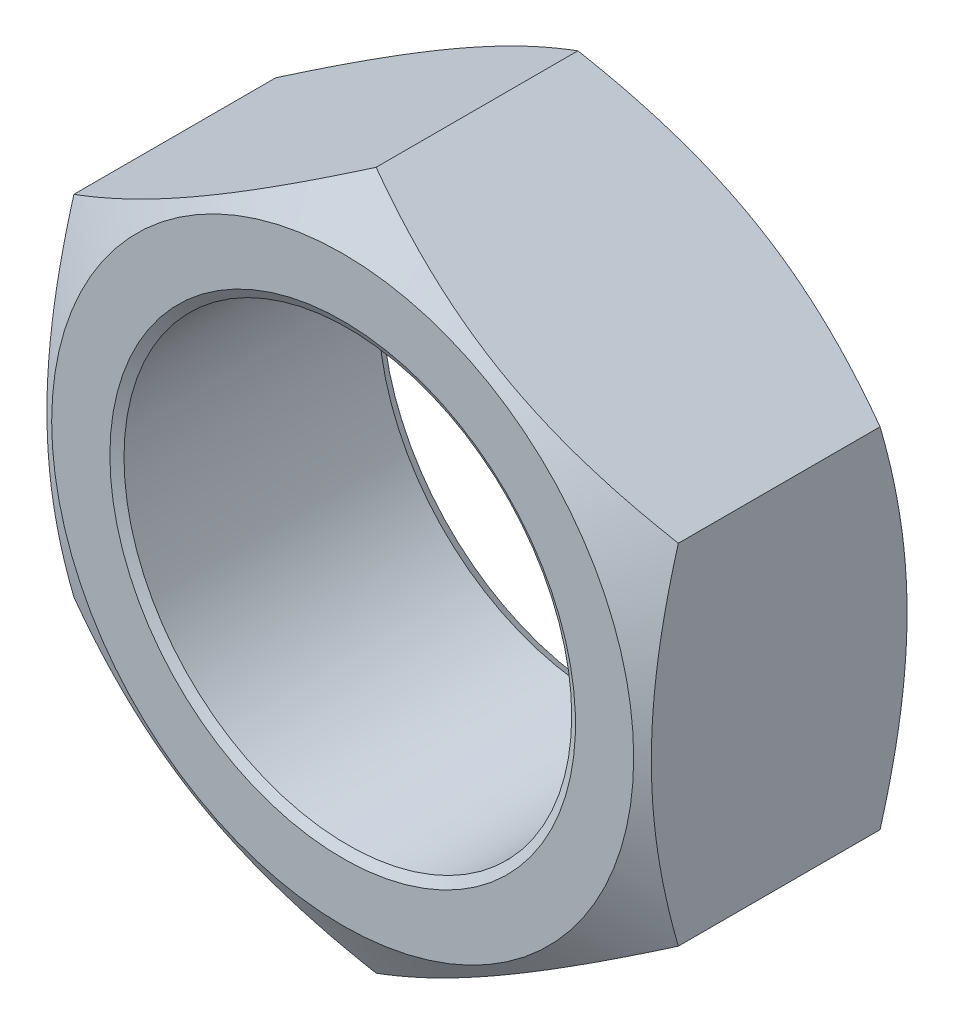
ISO-10303-21;
HEADER;
FILE_DESCRIPTION(('STEP AP214'),'2;1');
FILE_NAME('part.step','',(''),(''),'','','');
FILE_SCHEMA(('AUTOMOTIVE_DESIGN { 1 0 10303 214 1 1 1 1 }'));
ENDSEC;
DATA;
#1=APPLICATION_CONTEXT('core data for automotive mechanical design processes');
#2=APPLICATION_PROTOCOL_DEFINITION('international standard','automotive_design',2000,#1);
#3=PRODUCT_CONTEXT('',#1,'mechanical');
#4=PRODUCT('Part','Part','',(#3));
#5=PRODUCT_RELATED_PRODUCT_CATEGORY('part','',(#4));
#6=PRODUCT_DEFINITION_FORMATION('','',#4);
#7=PRODUCT_DEFINITION_CONTEXT('part definition',#1,'design');
#8=PRODUCT_DEFINITION('design','',#6,#7);
#9=PRODUCT_DEFINITION_SHAPE('','',#8);
#10=(LENGTH_UNIT() NAMED_UNIT(*) SI_UNIT(.MILLI.,.METRE.));
#11=(NAMED_UNIT(*) PLANE_ANGLE_UNIT() SI_UNIT($,.RADIAN.));
#12=(NAMED_UNIT(*) SI_UNIT($,.STERADIAN.) SOLID_ANGLE_UNIT());
#13=UNCERTAINTY_MEASURE_WITH_UNIT(LENGTH_MEASURE(1.E-05),#10,'distance_accuracy_value','');
#14=(GEOMETRIC_REPRESENTATION_CONTEXT(3) GLOBAL_UNCERTAINTY_ASSIGNED_CONTEXT((#13)) GLOBAL_UNIT_ASSIGNED_CONTEXT((#10,
#11,#12)) REPRESENTATION_CONTEXT('',''));
#15=CARTESIAN_POINT('',(0.,0.,0.));
#16=DIRECTION('',(0.,0.,1.));
#17=DIRECTION('',(1.,0.,0.));
#18=AXIS2_PLACEMENT_3D('',#15,#16,#17);
#19=CARTESIAN_POINT('',(17.145,9.89867036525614,7.62));
#20=DIRECTION('',(0.,0.,-1.));
#21=DIRECTION('',(-1.,0.,0.));
#22=AXIS2_PLACEMENT_3D('',#19,#20,#21);
#23=PLANE('',#22);
#24=CARTESIAN_POINT('',(0.,0.,7.62));
#25=DIRECTION('',(0.,0.,-1.));
#26=DIRECTION('',(-1.,0.,0.));
#27=AXIS2_PLACEMENT_3D('',#24,#25,#26);
#28=CIRCLE('',#27,13.208);
#29=CARTESIAN_POINT('',(-13.208,0.,7.62));
#30=VERTEX_POINT('',#29);
#31=EDGE_CURVE('E12',#30,#30,#28,.T.);
#32=ORIENTED_EDGE('',*,*,#31,.T.);
#33=EDGE_LOOP('',(#32));
#34=FACE_BOUND('',#33,.T.);
#35=CARTESIAN_POINT('',(0.,0.,7.62));
#36=DIRECTION('',(0.,0.,1.));
#37=DIRECTION('',(1.,0.,0.));
#38=AXIS2_PLACEMENT_3D('',#35,#36,#37);
#39=CIRCLE('',#38,16.51);
#40=CARTESIAN_POINT('',(16.51,0.,7.62));
#41=VERTEX_POINT('',#40);
#42=EDGE_CURVE('E202',#41,#41,#39,.T.);
#43=ORIENTED_EDGE('',*,*,#42,.T.);
#44=EDGE_LOOP('',(#43));
#45=FACE_BOUND('',#44,.T.);
#46=ADVANCED_FACE('F33',(#34,#45),#23,.F.);
#47=CARTESIAN_POINT('',(17.145,9.89867036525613,7.62));
#48=DIRECTION('',(-0.5,-0.866025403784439,0.));
#49=DIRECTION('',(0.866025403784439,-0.5,0.));
#50=AXIS2_PLACEMENT_3D('',#47,#48,#49);
#51=PLANE('',#50);
#52=DIRECTION('',(0.,0.,-1.));
#53=VECTOR('',#52,1.);
#54=CARTESIAN_POINT('',(17.145,9.89867036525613,7.62));
#55=LINE('',#54,#53);
#56=CARTESIAN_POINT('',(17.145,9.89867036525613,5.72205294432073));
#57=VERTEX_POINT('',#56);
#58=CARTESIAN_POINT('',(17.145,9.89867036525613,-5.72205294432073));
#59=VERTEX_POINT('',#58);
#60=EDGE_CURVE('E105',#57,#59,#55,.T.);
#61=ORIENTED_EDGE('',*,*,#60,.T.);
#62=CARTESIAN_POINT('',(17.1452,9.8985548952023,-5.72198627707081));
#63=CARTESIAN_POINT('',(16.7683598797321,10.1161236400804,-5.84759111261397));
#64=CARTESIAN_POINT('',(16.3900498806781,10.3345410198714,-5.96749620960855));
#65=CARTESIAN_POINT('',(15.6303962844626,10.7731272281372,-6.19432259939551));
#66=CARTESIAN_POINT('',(15.2490517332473,10.9932966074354,-6.30123962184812));
#67=CARTESIAN_POINT('',(14.4825920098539,11.4358123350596,-6.50065268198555));
#68=CARTESIAN_POINT('',(14.0974701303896,11.6581625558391,-6.59311459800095));
#69=CARTESIAN_POINT('',(13.3245503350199,12.1044080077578,-6.76163198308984));
#70=CARTESIAN_POINT('',(12.9367525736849,12.3283031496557,-6.83768839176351));
#71=CARTESIAN_POINT('',(12.1684177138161,12.7719014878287,-6.97015986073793));
#72=CARTESIAN_POINT('',(11.7879376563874,12.9915717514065,-7.02701337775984));
#73=CARTESIAN_POINT('',(11.0252341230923,13.4319188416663,-7.1223440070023));
#74=CARTESIAN_POINT('',(10.6430106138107,13.6525956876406,-7.16082076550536));
#75=CARTESIAN_POINT('',(9.87792152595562,14.0943200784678,-7.2184263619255));
#76=CARTESIAN_POINT('',(9.49505725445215,14.3153668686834,-7.23757819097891));
#77=CARTESIAN_POINT('',(8.72897530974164,14.7576644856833,-7.2561220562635));
#78=CARTESIAN_POINT('',(8.34575764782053,14.9789153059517,-7.25551470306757));
#79=CARTESIAN_POINT('',(7.62932277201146,15.3925491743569,-7.23592013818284));
#80=CARTESIAN_POINT('',(7.29605451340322,15.5849616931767,-7.21932230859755));
#81=CARTESIAN_POINT('',(6.63031296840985,15.9693277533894,-7.17149744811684));
#82=CARTESIAN_POINT('',(6.29783967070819,16.1612813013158,-7.14027062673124));
#83=CARTESIAN_POINT('',(5.63381401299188,16.5446566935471,-7.06372962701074));
#84=CARTESIAN_POINT('',(5.30226276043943,16.7360778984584,-7.0184027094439));
#85=CARTESIAN_POINT('',(4.6407385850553,17.1180090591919,-6.91446136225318));
#86=CARTESIAN_POINT('',(4.31076565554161,17.3085190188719,-6.85584698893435));
#87=CARTESIAN_POINT('',(3.30909024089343,17.8868365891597,-6.6585819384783));
#88=CARTESIAN_POINT('',(2.64028851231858,18.2729694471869,-6.50026135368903));
#89=CARTESIAN_POINT('',(1.31265759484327,19.0394775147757,-6.1409385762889));
#90=CARTESIAN_POINT('',(0.653811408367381,19.4198625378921,-5.94002076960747));
#91=CARTESIAN_POINT('',(-0.000199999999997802,19.7974562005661,-5.72198627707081));
#92=B_SPLINE_CURVE_WITH_KNOTS('',3,(#62,#63,#64,#65,#66,#67,#68,#69,#70,#71,#72,#73,#74,#75,#76,
#77,#78,#79,#80,#81,#82,#83,#84,#85,#86,#87,#88,#89,#90,#91),.UNSPECIFIED.,.F.,.F.,(4,2,2,2,2,2,
2,2,2,2,2,2,2,2,4),(0.,1.35874482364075,2.7179351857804,4.08028702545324,5.442560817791,
6.77121074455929,8.09988624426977,9.42697912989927,10.754031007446,11.9093009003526,
13.0645542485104,14.2208543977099,15.3771496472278,17.7406738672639,20.0995589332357),.UNSPECIFIED.);
#93=CARTESIAN_POINT('',(0.,19.7973407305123,-5.72205294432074));
#94=VERTEX_POINT('',#93);
#95=EDGE_CURVE('E48',#59,#94,#92,.T.);
#96=ORIENTED_EDGE('',*,*,#95,.T.);
#97=DIRECTION('',(0.,0.,-1.));
#98=VECTOR('',#97,1.);
#99=CARTESIAN_POINT('',(0.,19.7973407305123,7.62));
#100=LINE('',#99,#98);
#101=CARTESIAN_POINT('',(0.,19.7973407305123,5.72205294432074));
#102=VERTEX_POINT('',#101);
#103=EDGE_CURVE('E118',#102,#94,#100,.T.);
#104=ORIENTED_EDGE('',*,*,#103,.F.);
#105=CARTESIAN_POINT('',(17.1452,9.8985548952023,5.72198627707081));
#106=CARTESIAN_POINT('',(16.7683598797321,10.1161236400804,5.84759111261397));
#107=CARTESIAN_POINT('',(16.3900498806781,10.3345410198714,5.96749620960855));
#108=CARTESIAN_POINT('',(15.6303962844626,10.7731272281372,6.19432259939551));
#109=CARTESIAN_POINT('',(15.2490517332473,10.9932966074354,6.30123962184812));
#110=CARTESIAN_POINT('',(14.4825920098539,11.4358123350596,6.50065268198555));
#111=CARTESIAN_POINT('',(14.0974701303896,11.6581625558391,6.59311459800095));
#112=CARTESIAN_POINT('',(13.3245503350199,12.1044080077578,6.76163198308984));
#113=CARTESIAN_POINT('',(12.9367525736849,12.3283031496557,6.83768839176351));
#114=CARTESIAN_POINT('',(12.1684177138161,12.7719014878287,6.97015986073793));
#115=CARTESIAN_POINT('',(11.7879376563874,12.9915717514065,7.02701337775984));
#116=CARTESIAN_POINT('',(11.0252341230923,13.4319188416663,7.1223440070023));
#117=CARTESIAN_POINT('',(10.6430106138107,13.6525956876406,7.16082076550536));
#118=CARTESIAN_POINT('',(9.87792152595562,14.0943200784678,7.2184263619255));
#119=CARTESIAN_POINT('',(9.49505725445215,14.3153668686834,7.23757819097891));
#120=CARTESIAN_POINT('',(8.72897530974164,14.7576644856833,7.2561220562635));
#121=CARTESIAN_POINT('',(8.34575764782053,14.9789153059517,7.25551470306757));
#122=CARTESIAN_POINT('',(7.62932277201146,15.3925491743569,7.23592013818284));
#123=CARTESIAN_POINT('',(7.29605451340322,15.5849616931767,7.21932230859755));
#124=CARTESIAN_POINT('',(6.63031296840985,15.9693277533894,7.17149744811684));
#125=CARTESIAN_POINT('',(6.29783967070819,16.1612813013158,7.14027062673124));
#126=CARTESIAN_POINT('',(5.63381401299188,16.5446566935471,7.06372962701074));
#127=CARTESIAN_POINT('',(5.30226276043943,16.7360778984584,7.0184027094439));
#128=CARTESIAN_POINT('',(4.6407385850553,17.1180090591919,6.91446136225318));
#129=CARTESIAN_POINT('',(4.31076565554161,17.3085190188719,6.85584698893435));
#130=CARTESIAN_POINT('',(3.30909024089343,17.8868365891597,6.6585819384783));
#131=CARTESIAN_POINT('',(2.64028851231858,18.2729694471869,6.50026135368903));
#132=CARTESIAN_POINT('',(1.31265759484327,19.0394775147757,6.1409385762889));
#133=CARTESIAN_POINT('',(0.653811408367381,19.4198625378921,5.94002076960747));
#134=CARTESIAN_POINT('',(-0.000199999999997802,19.7974562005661,5.72198627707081));
#135=B_SPLINE_CURVE_WITH_KNOTS('',3,(#105,#106,#107,#108,#109,#110,#111,#112,#113,#114,#115,
#116,#117,#118,#119,#120,#121,#122,#123,#124,#125,#126,#127,#128,#129,#130,#131,#132,#133,#134),
.UNSPECIFIED.,.F.,.F.,(4,2,2,2,2,2,2,2,2,2,2,2,2,2,4),(0.,1.35874482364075,2.7179351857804,
4.08028702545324,5.442560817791,6.77121074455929,8.09988624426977,9.42697912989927,
10.754031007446,11.9093009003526,13.0645542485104,14.2208543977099,15.3771496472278,
17.7406738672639,20.0995589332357),.UNSPECIFIED.);
#136=EDGE_CURVE('E109',#57,#102,#135,.T.);
#137=ORIENTED_EDGE('',*,*,#136,.F.);
#138=EDGE_LOOP('',(#61,#96,#104,#137));
#139=FACE_BOUND('',#138,.T.);
#140=ADVANCED_FACE('F203',(#139),#51,.F.);
#141=CARTESIAN_POINT('',(0.,19.7973407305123,7.62));
#142=DIRECTION('',(0.499999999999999,-0.866025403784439,0.));
#143=DIRECTION('',(0.866025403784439,0.499999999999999,0.));
#144=AXIS2_PLACEMENT_3D('',#141,#142,#143);
#145=PLANE('',#144);
#146=ORIENTED_EDGE('',*,*,#103,.T.);
#147=CARTESIAN_POINT('',(0.000200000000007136,19.7974562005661,-5.72198627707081));
#148=CARTESIAN_POINT('',(-0.3766401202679,19.579887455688,-5.84759111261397));
#149=CARTESIAN_POINT('',(-0.75495011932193,19.361470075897,-5.96749620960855));
#150=CARTESIAN_POINT('',(-1.51460371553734,18.9228838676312,-6.19432259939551));
#151=CARTESIAN_POINT('',(-1.8959482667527,18.702714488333,-6.30123962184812));
#152=CARTESIAN_POINT('',(-2.66240799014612,18.2601987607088,-6.50065268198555));
#153=CARTESIAN_POINT('',(-3.04752986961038,18.0378485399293,-6.59311459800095));
#154=CARTESIAN_POINT('',(-3.82044966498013,17.5916030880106,-6.76163198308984));
#155=CARTESIAN_POINT('',(-4.20824742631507,17.3677079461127,-6.83768839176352));
#156=CARTESIAN_POINT('',(-4.97658228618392,16.9241096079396,-6.97015986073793));
#157=CARTESIAN_POINT('',(-5.35706234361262,16.7044393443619,-7.02701337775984));
#158=CARTESIAN_POINT('',(-6.11976587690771,16.2640922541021,-7.1223440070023));
#159=CARTESIAN_POINT('',(-6.50198938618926,16.0434154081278,-7.16082076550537));
#160=CARTESIAN_POINT('',(-7.26707847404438,15.6016910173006,-7.2184263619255));
#161=CARTESIAN_POINT('',(-7.64994274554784,15.380644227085,-7.23757819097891));
#162=CARTESIAN_POINT('',(-8.41602469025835,14.9383466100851,-7.2561220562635));
#163=CARTESIAN_POINT('',(-8.79924235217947,14.7170957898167,-7.25551470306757));
#164=CARTESIAN_POINT('',(-9.51567722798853,14.3034619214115,-7.23592013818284));
#165=CARTESIAN_POINT('',(-9.84894548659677,14.1110494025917,-7.21932230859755));
#166=CARTESIAN_POINT('',(-10.5146870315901,13.726683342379,-7.17149744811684));
#167=CARTESIAN_POINT('',(-10.8471603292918,13.5347297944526,-7.14027062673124));
#168=CARTESIAN_POINT('',(-11.5111859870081,13.1513544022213,-7.06372962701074));
#169=CARTESIAN_POINT('',(-11.8427372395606,12.95993319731,-7.01840270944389));
#170=CARTESIAN_POINT('',(-12.5042614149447,12.5780020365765,-6.91446136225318));
#171=CARTESIAN_POINT('',(-12.8342343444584,12.3874920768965,-6.85584698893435));
#172=CARTESIAN_POINT('',(-13.8359097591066,11.8091745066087,-6.6585819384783));
#173=CARTESIAN_POINT('',(-14.5047114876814,11.4230416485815,-6.50026135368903));
#174=CARTESIAN_POINT('',(-15.8323424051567,10.6565335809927,-6.14093857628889));
#175=CARTESIAN_POINT('',(-16.4911885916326,10.2761485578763,-5.94002076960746));
#176=CARTESIAN_POINT('',(-17.1452,9.8985548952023,-5.72198627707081));
#177=B_SPLINE_CURVE_WITH_KNOTS('',3,(#147,#148,#149,#150,#151,#152,#153,#154,#155,#156,#157,
#158,#159,#160,#161,#162,#163,#164,#165,#166,#167,#168,#169,#170,#171,#172,#173,#174,#175,#176),
.UNSPECIFIED.,.F.,.F.,(4,2,2,2,2,2,2,2,2,2,2,2,2,2,4),(0.,1.35874482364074,2.7179351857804,
4.08028702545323,5.44256081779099,6.77121074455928,8.09988624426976,9.42697912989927,
10.754031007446,11.9093009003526,13.0645542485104,14.2208543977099,15.3771496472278,
17.7406738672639,20.0995589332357),.UNSPECIFIED.);
#178=CARTESIAN_POINT('',(-17.145,9.89867036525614,-5.72205294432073));
#179=VERTEX_POINT('',#178);
#180=EDGE_CURVE('E190',#94,#179,#177,.T.);
#181=ORIENTED_EDGE('',*,*,#180,.T.);
#182=DIRECTION('',(0.,0.,-1.));
#183=VECTOR('',#182,1.);
#184=CARTESIAN_POINT('',(-17.145,9.89867036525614,7.62));
#185=LINE('',#184,#183);
#186=CARTESIAN_POINT('',(-17.145,9.89867036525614,5.72205294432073));
#187=VERTEX_POINT('',#186);
#188=EDGE_CURVE('E115',#187,#179,#185,.T.);
#189=ORIENTED_EDGE('',*,*,#188,.F.);
#190=CARTESIAN_POINT('',(0.000200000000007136,19.7974562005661,5.72198627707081));
#191=CARTESIAN_POINT('',(-0.3766401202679,19.579887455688,5.84759111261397));
#192=CARTESIAN_POINT('',(-0.75495011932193,19.361470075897,5.96749620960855));
#193=CARTESIAN_POINT('',(-1.51460371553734,18.9228838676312,6.19432259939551));
#194=CARTESIAN_POINT('',(-1.8959482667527,18.702714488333,6.30123962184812));
#195=CARTESIAN_POINT('',(-2.66240799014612,18.2601987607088,6.50065268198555));
#196=CARTESIAN_POINT('',(-3.04752986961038,18.0378485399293,6.59311459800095));
#197=CARTESIAN_POINT('',(-3.82044966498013,17.5916030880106,6.76163198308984));
#198=CARTESIAN_POINT('',(-4.20824742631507,17.3677079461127,6.83768839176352));
#199=CARTESIAN_POINT('',(-4.97658228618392,16.9241096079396,6.97015986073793));
#200=CARTESIAN_POINT('',(-5.35706234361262,16.7044393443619,7.02701337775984));
#201=CARTESIAN_POINT('',(-6.11976587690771,16.2640922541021,7.1223440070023));
#202=CARTESIAN_POINT('',(-6.50198938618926,16.0434154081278,7.16082076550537));
#203=CARTESIAN_POINT('',(-7.26707847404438,15.6016910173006,7.2184263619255));
#204=CARTESIAN_POINT('',(-7.64994274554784,15.380644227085,7.23757819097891));
#205=CARTESIAN_POINT('',(-8.41602469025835,14.9383466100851,7.2561220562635));
#206=CARTESIAN_POINT('',(-8.79924235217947,14.7170957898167,7.25551470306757));
#207=CARTESIAN_POINT('',(-9.51567722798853,14.3034619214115,7.23592013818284));
#208=CARTESIAN_POINT('',(-9.84894548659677,14.1110494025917,7.21932230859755));
#209=CARTESIAN_POINT('',(-10.5146870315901,13.726683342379,7.17149744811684));
#210=CARTESIAN_POINT('',(-10.8471603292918,13.5347297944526,7.14027062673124));
#211=CARTESIAN_POINT('',(-11.5111859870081,13.1513544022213,7.06372962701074));
#212=CARTESIAN_POINT('',(-11.8427372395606,12.95993319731,7.01840270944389));
#213=CARTESIAN_POINT('',(-12.5042614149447,12.5780020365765,6.91446136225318));
#214=CARTESIAN_POINT('',(-12.8342343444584,12.3874920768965,6.85584698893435));
#215=CARTESIAN_POINT('',(-13.8359097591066,11.8091745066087,6.6585819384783));
#216=CARTESIAN_POINT('',(-14.5047114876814,11.4230416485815,6.50026135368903));
#217=CARTESIAN_POINT('',(-15.8323424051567,10.6565335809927,6.14093857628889));
#218=CARTESIAN_POINT('',(-16.4911885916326,10.2761485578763,5.94002076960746));
#219=CARTESIAN_POINT('',(-17.1452,9.8985548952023,5.72198627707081));
#220=B_SPLINE_CURVE_WITH_KNOTS('',3,(#190,#191,#192,#193,#194,#195,#196,#197,#198,#199,#200,
#201,#202,#203,#204,#205,#206,#207,#208,#209,#210,#211,#212,#213,#214,#215,#216,#217,#218,#219),
.UNSPECIFIED.,.F.,.F.,(4,2,2,2,2,2,2,2,2,2,2,2,2,2,4),(0.,1.35874482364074,2.7179351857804,
4.08028702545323,5.44256081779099,6.77121074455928,8.09988624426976,9.42697912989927,
10.754031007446,11.9093009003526,13.0645542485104,14.2208543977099,15.3771496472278,
17.7406738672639,20.0995589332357),.UNSPECIFIED.);
#221=EDGE_CURVE('E168',#102,#187,#220,.T.);
#222=ORIENTED_EDGE('',*,*,#221,.F.);
#223=EDGE_LOOP('',(#146,#181,#189,#222));
#224=FACE_BOUND('',#223,.T.);
#225=ADVANCED_FACE('F177',(#224),#145,.F.);
#226=CARTESIAN_POINT('',(-17.145,9.89867036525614,7.62));
#227=DIRECTION('',(1.,0.,0.));
#228=DIRECTION('',(0.,1.,0.));
#229=AXIS2_PLACEMENT_3D('',#226,#227,#228);
#230=PLANE('',#229);
#231=ORIENTED_EDGE('',*,*,#188,.T.);
#232=CARTESIAN_POINT('',(-17.145,-26.9599779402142,1.29418818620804));
#233=CARTESIAN_POINT('',(-17.145,-26.5839206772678,1.11098372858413));
#234=CARTESIAN_POINT('',(-17.145,-26.2074319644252,0.92866530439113));
#235=CARTESIAN_POINT('',(-17.145,-25.4535017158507,0.566000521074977));
#236=CARTESIAN_POINT('',(-17.145,-25.0760601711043,0.38565418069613));
#237=CARTESIAN_POINT('',(-17.145,-23.9420758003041,-0.152171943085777));
#238=CARTESIAN_POINT('',(-17.145,-23.1839789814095,-0.506387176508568));
#239=CARTESIAN_POINT('',(-17.145,-21.6588840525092,-1.20586667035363));
#240=CARTESIAN_POINT('',(-17.145,-20.8918601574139,-1.55107484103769));
#241=CARTESIAN_POINT('',(-17.145,-19.3518396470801,-2.22785305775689));
#242=CARTESIAN_POINT('',(-17.145,-18.5788433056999,-2.5594237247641));
#243=CARTESIAN_POINT('',(-17.145,-16.9995513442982,-3.21618225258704));
#244=CARTESIAN_POINT('',(-17.145,-16.1930095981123,-3.54078124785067));
#245=CARTESIAN_POINT('',(-17.145,-14.570623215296,-4.16629972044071));
#246=CARTESIAN_POINT('',(-17.145,-13.7547775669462,-4.46721659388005));
#247=CARTESIAN_POINT('',(-17.145,-12.1139206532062,-5.03773845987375));
#248=CARTESIAN_POINT('',(-17.145,-11.2889305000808,-5.30740370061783));
#249=CARTESIAN_POINT('',(-17.145,-9.62704642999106,-5.8070335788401));
#250=CARTESIAN_POINT('',(-17.145,-8.79015622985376,-6.03701032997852));
#251=CARTESIAN_POINT('',(-17.145,-7.52799258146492,-6.34345666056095));
#252=CARTESIAN_POINT('',(-17.145,-7.10731775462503,-6.43897204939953));
#253=CARTESIAN_POINT('',(-17.145,-6.26302714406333,-6.61605368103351));
#254=CARTESIAN_POINT('',(-17.145,-5.83941141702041,-6.69762019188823));
#255=CARTESIAN_POINT('',(-17.145,-4.98950520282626,-6.84538798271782));
#256=CARTESIAN_POINT('',(-17.145,-4.56321477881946,-6.91158962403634));
#257=CARTESIAN_POINT('',(-17.145,-3.70838067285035,-7.02732217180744));
#258=CARTESIAN_POINT('',(-17.145,-3.27983709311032,-7.07685382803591));
#259=CARTESIAN_POINT('',(-17.145,-2.4268511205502,-7.15762030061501));
#260=CARTESIAN_POINT('',(-17.145,-2.00243138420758,-7.18909291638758));
#261=CARTESIAN_POINT('',(-17.145,-1.15264086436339,-7.23404568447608));
#262=CARTESIAN_POINT('',(-17.145,-0.727270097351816,-7.24752614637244));
#263=CARTESIAN_POINT('',(-17.145,0.123665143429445,-7.25617201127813));
#264=CARTESIAN_POINT('',(-17.145,0.549229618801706,-7.25133725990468));
#265=CARTESIAN_POINT('',(-17.145,1.39976667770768,-7.223474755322));
#266=CARTESIAN_POINT('',(-17.145,1.82473923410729,-7.2004461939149));
#267=CARTESIAN_POINT('',(-17.145,2.83483933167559,-7.12458441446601));
#268=CARTESIAN_POINT('',(-17.145,3.41937926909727,-7.06374468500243));
#269=CARTESIAN_POINT('',(-17.145,4.58433526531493,-6.9108789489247));
#270=CARTESIAN_POINT('',(-17.145,5.16475079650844,-6.81884902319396));
#271=CARTESIAN_POINT('',(-17.145,6.89900662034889,-6.50083678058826));
#272=CARTESIAN_POINT('',(-17.145,8.04528210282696,-6.23298100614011));
#273=CARTESIAN_POINT('',(-17.145,9.76020810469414,-5.76565387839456));
#274=CARTESIAN_POINT('',(-17.145,10.3376691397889,-5.59663193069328));
#275=CARTESIAN_POINT('',(-17.145,11.4869872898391,-5.24033574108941));
#276=CARTESIAN_POINT('',(-17.145,12.0588443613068,-5.05306135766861));
#277=CARTESIAN_POINT('',(-17.145,13.1971327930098,-4.66332075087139));
#278=CARTESIAN_POINT('',(-17.145,13.76356564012,-4.46085883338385));
#279=CARTESIAN_POINT('',(-17.145,14.6096527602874,-4.14761460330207));
#280=CARTESIAN_POINT('',(-17.145,14.8910864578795,-4.0416086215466));
#281=CARTESIAN_POINT('',(-17.145,15.4528378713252,-3.82667659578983));
#282=CARTESIAN_POINT('',(-17.145,15.7331555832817,-3.71775054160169));
#283=CARTESIAN_POINT('',(-17.145,16.4952222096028,-3.41743639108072));
#284=CARTESIAN_POINT('',(-17.145,16.9759357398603,-3.2234185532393));
#285=CARTESIAN_POINT('',(-17.145,17.9345610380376,-2.8285671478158));
#286=CARTESIAN_POINT('',(-17.145,18.4124727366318,-2.62773341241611));
#287=CARTESIAN_POINT('',(-17.145,19.3658207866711,-2.22017017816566));
#288=CARTESIAN_POINT('',(-17.145,19.8412569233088,-2.01344017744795));
#289=CARTESIAN_POINT('',(-17.145,20.7898817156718,-1.5948813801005));
#290=CARTESIAN_POINT('',(-17.145,21.2630703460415,-1.38305252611));
#291=CARTESIAN_POINT('',(-17.145,22.6799876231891,-0.740780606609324));
#292=CARTESIAN_POINT('',(-17.145,23.6207119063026,-0.303705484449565));
#293=CARTESIAN_POINT('',(-17.145,25.4957011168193,0.5839222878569));
#294=CARTESIAN_POINT('',(-17.145,26.42996631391,1.03447437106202));
#295=CARTESIAN_POINT('',(-17.145,28.2948577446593,1.94685240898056));
#296=CARTESIAN_POINT('',(-17.145,29.2254755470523,2.40869556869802));
#297=CARTESIAN_POINT('',(-17.145,31.0825189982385,3.34073898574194));
#298=CARTESIAN_POINT('',(-17.145,32.0089446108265,3.81093931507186));
#299=CARTESIAN_POINT('',(-17.145,33.8581514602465,4.7579394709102));
#300=CARTESIAN_POINT('',(-17.145,34.7809334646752,5.2347378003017));
#301=CARTESIAN_POINT('',(-17.145,36.6236552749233,6.19378285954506));
#302=CARTESIAN_POINT('',(-17.145,37.54359509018,6.67602957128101));
#303=CARTESIAN_POINT('',(-17.145,39.2825954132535,7.5930602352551));
#304=CARTESIAN_POINT('',(-17.145,40.1018961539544,8.02738900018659));
#305=CARTESIAN_POINT('',(-17.145,41.7388804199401,8.89908455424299));
#306=CARTESIAN_POINT('',(-17.145,42.5565639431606,9.3364513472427));
#307=CARTESIAN_POINT('',(-17.145,45.0076343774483,10.6524792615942));
#308=CARTESIAN_POINT('',(-17.145,46.6389410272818,11.5350149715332));
#309=CARTESIAN_POINT('',(-17.145,49.8918474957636,13.3047636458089));
#310=CARTESIAN_POINT('',(-17.145,51.5134614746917,14.1919506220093));
#311=CARTESIAN_POINT('',(-17.145,53.9433995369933,15.5270933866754));
#312=CARTESIAN_POINT('',(-17.145,54.7529329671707,15.9728502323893));
#313=CARTESIAN_POINT('',(-17.145,56.3712805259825,16.8656655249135));
#314=CARTESIAN_POINT('',(-17.145,57.1800946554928,17.3127239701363));
#315=CARTESIAN_POINT('',(-17.145,57.9885935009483,17.7603517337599));
#316=B_SPLINE_CURVE_WITH_KNOTS('',3,(#232,#233,#234,#235,#236,#237,#238,#239,#240,#241,#242,
#243,#244,#245,#246,#247,#248,#249,#250,#251,#252,#253,#254,#255,#256,#257,#258,#259,#260,#261,
#262,#263,#264,#265,#266,#267,#268,#269,#270,#271,#272,#273,#274,#275,#276,#277,#278,#279,#280,
#281,#282,#283,#284,#285,#286,#287,#288,#289,#290,#291,#292,#293,#294,#295,#296,#297,#298,#299,
#300,#301,#302,#303,#304,#305,#306,#307,#308,#309,#310,#311,#312,#313,#314,#315),.UNSPECIFIED.,
.F.,.F.,(4,2,2,2,2,2,2,2,2,2,2,2,2,2,2,2,2,2,2,2,2,2,2,2,2,2,2,2,2,2,2,2,2,2,2,2,2,2,2,2,2,4),
(0.,1.25492670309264,2.50986532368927,5.02009560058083,7.54337245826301,10.0665342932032,
12.6744808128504,15.2827136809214,17.8858315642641,20.4881535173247,21.7821059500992,
23.0760335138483,24.3699306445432,25.6637695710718,26.9401554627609,28.2165193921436,
29.4928940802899,30.7693254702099,32.5314307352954,34.2937574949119,37.8201315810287,
39.6250368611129,41.4299561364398,43.2343656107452,44.1365596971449,45.0387569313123,
46.5938613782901,48.1490041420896,49.7042796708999,51.259572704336,54.3713206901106,
57.4829379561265,60.5996353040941,63.716359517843,66.8323877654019,69.9484056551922,
72.7303144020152,75.5122266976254,81.076391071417,86.6216981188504,89.3941314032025,
92.1665613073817),.UNSPECIFIED.);
#317=CARTESIAN_POINT('',(-17.145,-9.89867036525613,-5.72205294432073));
#318=VERTEX_POINT('',#317);
#319=EDGE_CURVE('E183',#179,#318,#316,.F.);
#320=ORIENTED_EDGE('',*,*,#319,.T.);
#321=DIRECTION('',(0.,0.,-1.));
#322=VECTOR('',#321,1.);
#323=CARTESIAN_POINT('',(-17.145,-9.89867036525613,7.62));
#324=LINE('',#323,#322);
#325=CARTESIAN_POINT('',(-17.145,-9.89867036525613,5.72205294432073));
#326=VERTEX_POINT('',#325);
#327=EDGE_CURVE('E107',#326,#318,#324,.T.);
#328=ORIENTED_EDGE('',*,*,#327,.F.);
#329=CARTESIAN_POINT('',(-17.145,-26.9599779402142,-1.29418818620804));
#330=CARTESIAN_POINT('',(-17.145,-26.5839206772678,-1.11098372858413));
#331=CARTESIAN_POINT('',(-17.145,-26.2074319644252,-0.92866530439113));
#332=CARTESIAN_POINT('',(-17.145,-25.4535017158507,-0.566000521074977));
#333=CARTESIAN_POINT('',(-17.145,-25.0760601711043,-0.38565418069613));
#334=CARTESIAN_POINT('',(-17.145,-23.9420758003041,0.152171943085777));
#335=CARTESIAN_POINT('',(-17.145,-23.1839789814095,0.506387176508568));
#336=CARTESIAN_POINT('',(-17.145,-21.6588840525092,1.20586667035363));
#337=CARTESIAN_POINT('',(-17.145,-20.8918601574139,1.55107484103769));
#338=CARTESIAN_POINT('',(-17.145,-19.3518396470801,2.22785305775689));
#339=CARTESIAN_POINT('',(-17.145,-18.5788433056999,2.5594237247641));
#340=CARTESIAN_POINT('',(-17.145,-16.9995513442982,3.21618225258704));
#341=CARTESIAN_POINT('',(-17.145,-16.1930095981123,3.54078124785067));
#342=CARTESIAN_POINT('',(-17.145,-14.570623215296,4.16629972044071));
#343=CARTESIAN_POINT('',(-17.145,-13.7547775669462,4.46721659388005));
#344=CARTESIAN_POINT('',(-17.145,-12.1139206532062,5.03773845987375));
#345=CARTESIAN_POINT('',(-17.145,-11.2889305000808,5.30740370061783));
#346=CARTESIAN_POINT('',(-17.145,-9.62704642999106,5.8070335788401));
#347=CARTESIAN_POINT('',(-17.145,-8.79015622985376,6.03701032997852));
#348=CARTESIAN_POINT('',(-17.145,-7.52799258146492,6.34345666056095));
#349=CARTESIAN_POINT('',(-17.145,-7.10731775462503,6.43897204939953));
#350=CARTESIAN_POINT('',(-17.145,-6.26302714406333,6.61605368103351));
#351=CARTESIAN_POINT('',(-17.145,-5.83941141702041,6.69762019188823));
#352=CARTESIAN_POINT('',(-17.145,-4.98950520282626,6.84538798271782));
#353=CARTESIAN_POINT('',(-17.145,-4.56321477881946,6.91158962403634));
#354=CARTESIAN_POINT('',(-17.145,-3.70838067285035,7.02732217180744));
#355=CARTESIAN_POINT('',(-17.145,-3.27983709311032,7.07685382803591));
#356=CARTESIAN_POINT('',(-17.145,-2.4268511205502,7.15762030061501));
#357=CARTESIAN_POINT('',(-17.145,-2.00243138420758,7.18909291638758));
#358=CARTESIAN_POINT('',(-17.145,-1.15264086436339,7.23404568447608));
#359=CARTESIAN_POINT('',(-17.145,-0.727270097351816,7.24752614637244));
#360=CARTESIAN_POINT('',(-17.145,0.123665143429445,7.25617201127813));
#361=CARTESIAN_POINT('',(-17.145,0.549229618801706,7.25133725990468));
#362=CARTESIAN_POINT('',(-17.145,1.39976667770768,7.223474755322));
#363=CARTESIAN_POINT('',(-17.145,1.82473923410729,7.2004461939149));
#364=CARTESIAN_POINT('',(-17.145,2.83483933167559,7.12458441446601));
#365=CARTESIAN_POINT('',(-17.145,3.41937926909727,7.06374468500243));
#366=CARTESIAN_POINT('',(-17.145,4.58433526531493,6.9108789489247));
#367=CARTESIAN_POINT('',(-17.145,5.16475079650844,6.81884902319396));
#368=CARTESIAN_POINT('',(-17.145,6.89900662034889,6.50083678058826));
#369=CARTESIAN_POINT('',(-17.145,8.04528210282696,6.23298100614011));
#370=CARTESIAN_POINT('',(-17.145,9.76020810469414,5.76565387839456));
#371=CARTESIAN_POINT('',(-17.145,10.3376691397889,5.59663193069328));
#372=CARTESIAN_POINT('',(-17.145,11.4869872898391,5.24033574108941));
#373=CARTESIAN_POINT('',(-17.145,12.0588443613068,5.05306135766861));
#374=CARTESIAN_POINT('',(-17.145,13.1971327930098,4.66332075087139));
#375=CARTESIAN_POINT('',(-17.145,13.76356564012,4.46085883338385));
#376=CARTESIAN_POINT('',(-17.145,14.6096527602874,4.14761460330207));
#377=CARTESIAN_POINT('',(-17.145,14.8910864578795,4.0416086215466));
#378=CARTESIAN_POINT('',(-17.145,15.4528378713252,3.82667659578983));
#379=CARTESIAN_POINT('',(-17.145,15.7331555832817,3.71775054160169));
#380=CARTESIAN_POINT('',(-17.145,16.4952222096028,3.41743639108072));
#381=CARTESIAN_POINT('',(-17.145,16.9759357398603,3.2234185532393));
#382=CARTESIAN_POINT('',(-17.145,17.9345610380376,2.8285671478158));
#383=CARTESIAN_POINT('',(-17.145,18.4124727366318,2.62773341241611));
#384=CARTESIAN_POINT('',(-17.145,19.3658207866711,2.22017017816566));
#385=CARTESIAN_POINT('',(-17.145,19.8412569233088,2.01344017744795));
#386=CARTESIAN_POINT('',(-17.145,20.7898817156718,1.5948813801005));
#387=CARTESIAN_POINT('',(-17.145,21.2630703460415,1.38305252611));
#388=CARTESIAN_POINT('',(-17.145,22.6799876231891,0.740780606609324));
#389=CARTESIAN_POINT('',(-17.145,23.6207119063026,0.303705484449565));
#390=CARTESIAN_POINT('',(-17.145,25.4957011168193,-0.5839222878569));
#391=CARTESIAN_POINT('',(-17.145,26.42996631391,-1.03447437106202));
#392=CARTESIAN_POINT('',(-17.145,28.2948577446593,-1.94685240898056));
#393=CARTESIAN_POINT('',(-17.145,29.2254755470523,-2.40869556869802));
#394=CARTESIAN_POINT('',(-17.145,31.0825189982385,-3.34073898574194));
#395=CARTESIAN_POINT('',(-17.145,32.0089446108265,-3.81093931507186));
#396=CARTESIAN_POINT('',(-17.145,33.8581514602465,-4.7579394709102));
#397=CARTESIAN_POINT('',(-17.145,34.7809334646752,-5.2347378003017));
#398=CARTESIAN_POINT('',(-17.145,36.6236552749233,-6.19378285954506));
#399=CARTESIAN_POINT('',(-17.145,37.54359509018,-6.67602957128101));
#400=CARTESIAN_POINT('',(-17.145,39.2825954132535,-7.5930602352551));
#401=CARTESIAN_POINT('',(-17.145,40.1018961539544,-8.02738900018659));
#402=CARTESIAN_POINT('',(-17.145,41.7388804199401,-8.89908455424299));
#403=CARTESIAN_POINT('',(-17.145,42.5565639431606,-9.3364513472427));
#404=CARTESIAN_POINT('',(-17.145,45.0076343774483,-10.6524792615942));
#405=CARTESIAN_POINT('',(-17.145,46.6389410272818,-11.5350149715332));
#406=CARTESIAN_POINT('',(-17.145,49.8918474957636,-13.3047636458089));
#407=CARTESIAN_POINT('',(-17.145,51.5134614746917,-14.1919506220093));
#408=CARTESIAN_POINT('',(-17.145,53.9433995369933,-15.5270933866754));
#409=CARTESIAN_POINT('',(-17.145,54.7529329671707,-15.9728502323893));
#410=CARTESIAN_POINT('',(-17.145,56.3712805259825,-16.8656655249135));
#411=CARTESIAN_POINT('',(-17.145,57.1800946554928,-17.3127239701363));
#412=CARTESIAN_POINT('',(-17.145,57.9885935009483,-17.7603517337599));
#413=B_SPLINE_CURVE_WITH_KNOTS('',3,(#329,#330,#331,#332,#333,#334,#335,#336,#337,#338,#339,
#340,#341,#342,#343,#344,#345,#346,#347,#348,#349,#350,#351,#352,#353,#354,#355,#356,#357,#358,
#359,#360,#361,#362,#363,#364,#365,#366,#367,#368,#369,#370,#371,#372,#373,#374,#375,#376,#377,
#378,#379,#380,#381,#382,#383,#384,#385,#386,#387,#388,#389,#390,#391,#392,#393,#394,#395,#396,
#397,#398,#399,#400,#401,#402,#403,#404,#405,#406,#407,#408,#409,#410,#411,#412),.UNSPECIFIED.,
.F.,.F.,(4,2,2,2,2,2,2,2,2,2,2,2,2,2,2,2,2,2,2,2,2,2,2,2,2,2,2,2,2,2,2,2,2,2,2,2,2,2,2,2,2,4),
(0.,1.25492670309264,2.50986532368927,5.02009560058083,7.54337245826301,10.0665342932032,
12.6744808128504,15.2827136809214,17.8858315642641,20.4881535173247,21.7821059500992,
23.0760335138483,24.3699306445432,25.6637695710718,26.9401554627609,28.2165193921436,
29.4928940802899,30.7693254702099,32.5314307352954,34.2937574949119,37.8201315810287,
39.6250368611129,41.4299561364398,43.2343656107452,44.1365596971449,45.0387569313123,
46.5938613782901,48.1490041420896,49.7042796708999,51.259572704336,54.3713206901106,
57.4829379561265,60.5996353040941,63.716359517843,66.8323877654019,69.9484056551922,
72.7303144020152,75.5122266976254,81.076391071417,86.6216981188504,89.3941314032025,
92.1665613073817),.UNSPECIFIED.);
#414=EDGE_CURVE('E163',#187,#326,#413,.F.);
#415=ORIENTED_EDGE('',*,*,#414,.F.);
#416=EDGE_LOOP('',(#231,#320,#328,#415));
#417=FACE_BOUND('',#416,.T.);
#418=ADVANCED_FACE('F173',(#417),#230,.F.);
#419=CARTESIAN_POINT('',(-17.145,-9.89867036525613,7.62));
#420=DIRECTION('',(0.5,0.866025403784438,0.));
#421=DIRECTION('',(-0.866025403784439,0.5,0.));
#422=AXIS2_PLACEMENT_3D('',#419,#420,#421);
#423=PLANE('',#422);
#424=ORIENTED_EDGE('',*,*,#327,.T.);
#425=CARTESIAN_POINT('',(-17.1452,-9.89855489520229,-5.72198627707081));
#426=CARTESIAN_POINT('',(-16.7683598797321,-10.1161236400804,-5.84759111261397));
#427=CARTESIAN_POINT('',(-16.3900498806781,-10.3345410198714,-5.96749620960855));
#428=CARTESIAN_POINT('',(-15.6303962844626,-10.7731272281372,-6.19432259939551));
#429=CARTESIAN_POINT('',(-15.2490517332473,-10.9932966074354,-6.30123962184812));
#430=CARTESIAN_POINT('',(-14.4825920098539,-11.4358123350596,-6.50065268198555));
#431=CARTESIAN_POINT('',(-14.0974701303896,-11.6581625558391,-6.59311459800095));
#432=CARTESIAN_POINT('',(-13.3245503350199,-12.1044080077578,-6.76163198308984));
#433=CARTESIAN_POINT('',(-12.9367525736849,-12.3283031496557,-6.83768839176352));
#434=CARTESIAN_POINT('',(-12.1684177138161,-12.7719014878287,-6.97015986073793));
#435=CARTESIAN_POINT('',(-11.7879376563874,-12.9915717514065,-7.02701337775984));
#436=CARTESIAN_POINT('',(-11.0252341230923,-13.4319188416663,-7.1223440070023));
#437=CARTESIAN_POINT('',(-10.6430106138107,-13.6525956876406,-7.16082076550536));
#438=CARTESIAN_POINT('',(-9.87792152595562,-14.0943200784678,-7.2184263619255));
#439=CARTESIAN_POINT('',(-9.49505725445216,-14.3153668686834,-7.23757819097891));
#440=CARTESIAN_POINT('',(-8.72897530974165,-14.7576644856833,-7.2561220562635));
#441=CARTESIAN_POINT('',(-8.34575764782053,-14.9789153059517,-7.25551470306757));
#442=CARTESIAN_POINT('',(-7.62932277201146,-15.3925491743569,-7.23592013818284));
#443=CARTESIAN_POINT('',(-7.29605451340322,-15.5849616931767,-7.21932230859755));
#444=CARTESIAN_POINT('',(-6.63031296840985,-15.9693277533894,-7.17149744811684));
#445=CARTESIAN_POINT('',(-6.29783967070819,-16.1612813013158,-7.14027062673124));
#446=CARTESIAN_POINT('',(-5.63381401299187,-16.5446566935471,-7.06372962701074));
#447=CARTESIAN_POINT('',(-5.30226276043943,-16.7360778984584,-7.01840270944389));
#448=CARTESIAN_POINT('',(-4.6407385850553,-17.1180090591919,-6.91446136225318));
#449=CARTESIAN_POINT('',(-4.3107656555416,-17.3085190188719,-6.85584698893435));
#450=CARTESIAN_POINT('',(-3.30909024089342,-17.8868365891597,-6.65858193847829));
#451=CARTESIAN_POINT('',(-2.64028851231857,-18.2729694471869,-6.50026135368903));
#452=CARTESIAN_POINT('',(-1.31265759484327,-19.0394775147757,-6.14093857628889));
#453=CARTESIAN_POINT('',(-0.653811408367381,-19.4198625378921,-5.94002076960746));
#454=CARTESIAN_POINT('',(0.000200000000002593,-19.7974562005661,-5.72198627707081));
#455=B_SPLINE_CURVE_WITH_KNOTS('',3,(#425,#426,#427,#428,#429,#430,#431,#432,#433,#434,#435,
#436,#437,#438,#439,#440,#441,#442,#443,#444,#445,#446,#447,#448,#449,#450,#451,#452,#453,#454),
.UNSPECIFIED.,.F.,.F.,(4,2,2,2,2,2,2,2,2,2,2,2,2,2,4),(0.,1.35874482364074,2.71793518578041,
4.08028702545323,5.442560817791,6.77121074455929,8.09988624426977,9.42697912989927,
10.754031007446,11.9093009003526,13.0645542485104,14.2208543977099,15.3771496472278,
17.7406738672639,20.0995589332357),.UNSPECIFIED.);
#456=CARTESIAN_POINT('',(0.,-19.7973407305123,-5.72205294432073));
#457=VERTEX_POINT('',#456);
#458=EDGE_CURVE('E101',#318,#457,#455,.T.);
#459=ORIENTED_EDGE('',*,*,#458,.T.);
#460=DIRECTION('',(0.,0.,-1.));
#461=VECTOR('',#460,1.);
#462=CARTESIAN_POINT('',(0.,-19.7973407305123,7.62));
#463=LINE('',#462,#461);
#464=CARTESIAN_POINT('',(0.,-19.7973407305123,5.72205294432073));
#465=VERTEX_POINT('',#464);
#466=EDGE_CURVE('E100',#465,#457,#463,.T.);
#467=ORIENTED_EDGE('',*,*,#466,.F.);
#468=CARTESIAN_POINT('',(-17.1452,-9.89855489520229,5.72198627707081));
#469=CARTESIAN_POINT('',(-16.7683598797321,-10.1161236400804,5.84759111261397));
#470=CARTESIAN_POINT('',(-16.3900498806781,-10.3345410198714,5.96749620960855));
#471=CARTESIAN_POINT('',(-15.6303962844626,-10.7731272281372,6.19432259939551));
#472=CARTESIAN_POINT('',(-15.2490517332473,-10.9932966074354,6.30123962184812));
#473=CARTESIAN_POINT('',(-14.4825920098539,-11.4358123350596,6.50065268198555));
#474=CARTESIAN_POINT('',(-14.0974701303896,-11.6581625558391,6.59311459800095));
#475=CARTESIAN_POINT('',(-13.3245503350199,-12.1044080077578,6.76163198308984));
#476=CARTESIAN_POINT('',(-12.9367525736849,-12.3283031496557,6.83768839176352));
#477=CARTESIAN_POINT('',(-12.1684177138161,-12.7719014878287,6.97015986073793));
#478=CARTESIAN_POINT('',(-11.7879376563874,-12.9915717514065,7.02701337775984));
#479=CARTESIAN_POINT('',(-11.0252341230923,-13.4319188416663,7.1223440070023));
#480=CARTESIAN_POINT('',(-10.6430106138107,-13.6525956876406,7.16082076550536));
#481=CARTESIAN_POINT('',(-9.87792152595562,-14.0943200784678,7.2184263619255));
#482=CARTESIAN_POINT('',(-9.49505725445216,-14.3153668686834,7.23757819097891));
#483=CARTESIAN_POINT('',(-8.72897530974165,-14.7576644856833,7.2561220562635));
#484=CARTESIAN_POINT('',(-8.34575764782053,-14.9789153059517,7.25551470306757));
#485=CARTESIAN_POINT('',(-7.62932277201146,-15.3925491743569,7.23592013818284));
#486=CARTESIAN_POINT('',(-7.29605451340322,-15.5849616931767,7.21932230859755));
#487=CARTESIAN_POINT('',(-6.63031296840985,-15.9693277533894,7.17149744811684));
#488=CARTESIAN_POINT('',(-6.29783967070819,-16.1612813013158,7.14027062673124));
#489=CARTESIAN_POINT('',(-5.63381401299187,-16.5446566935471,7.06372962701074));
#490=CARTESIAN_POINT('',(-5.30226276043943,-16.7360778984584,7.01840270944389));
#491=CARTESIAN_POINT('',(-4.6407385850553,-17.1180090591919,6.91446136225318));
#492=CARTESIAN_POINT('',(-4.3107656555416,-17.3085190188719,6.85584698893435));
#493=CARTESIAN_POINT('',(-3.30909024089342,-17.8868365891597,6.65858193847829));
#494=CARTESIAN_POINT('',(-2.64028851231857,-18.2729694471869,6.50026135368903));
#495=CARTESIAN_POINT('',(-1.31265759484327,-19.0394775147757,6.14093857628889));
#496=CARTESIAN_POINT('',(-0.653811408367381,-19.4198625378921,5.94002076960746));
#497=CARTESIAN_POINT('',(0.000200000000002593,-19.7974562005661,5.72198627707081));
#498=B_SPLINE_CURVE_WITH_KNOTS('',3,(#468,#469,#470,#471,#472,#473,#474,#475,#476,#477,#478,
#479,#480,#481,#482,#483,#484,#485,#486,#487,#488,#489,#490,#491,#492,#493,#494,#495,#496,#497),
.UNSPECIFIED.,.F.,.F.,(4,2,2,2,2,2,2,2,2,2,2,2,2,2,4),(0.,1.35874482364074,2.71793518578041,
4.08028702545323,5.442560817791,6.77121074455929,8.09988624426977,9.42697912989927,
10.754031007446,11.9093009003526,13.0645542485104,14.2208543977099,15.3771496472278,
17.7406738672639,20.0995589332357),.UNSPECIFIED.);
#499=EDGE_CURVE('E157',#326,#465,#498,.T.);
#500=ORIENTED_EDGE('',*,*,#499,.F.);
#501=EDGE_LOOP('',(#424,#459,#467,#500));
#502=FACE_BOUND('',#501,.T.);
#503=ADVANCED_FACE('F176',(#502),#423,.F.);
#504=CARTESIAN_POINT('',(0.,-19.7973407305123,7.62));
#505=DIRECTION('',(-0.5,0.866025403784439,0.));
#506=DIRECTION('',(-0.866025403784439,-0.5,0.));
#507=AXIS2_PLACEMENT_3D('',#504,#505,#506);
#508=PLANE('',#507);
#509=ORIENTED_EDGE('',*,*,#466,.T.);
#510=CARTESIAN_POINT('',(-0.000200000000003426,-19.7974562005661,-5.72198627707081));
#511=CARTESIAN_POINT('',(0.376640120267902,-19.579887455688,-5.84759111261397));
#512=CARTESIAN_POINT('',(0.754950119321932,-19.361470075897,-5.96749620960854));
#513=CARTESIAN_POINT('',(1.51460371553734,-18.9228838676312,-6.1943225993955));
#514=CARTESIAN_POINT('',(1.8959482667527,-18.702714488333,-6.30123962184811));
#515=CARTESIAN_POINT('',(2.66240799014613,-18.2601987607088,-6.50065268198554));
#516=CARTESIAN_POINT('',(3.04752986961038,-18.0378485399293,-6.59311459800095));
#517=CARTESIAN_POINT('',(3.82044966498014,-17.5916030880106,-6.76163198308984));
#518=CARTESIAN_POINT('',(4.20824742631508,-17.3677079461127,-6.83768839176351));
#519=CARTESIAN_POINT('',(4.97658228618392,-16.9241096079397,-6.97015986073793));
#520=CARTESIAN_POINT('',(5.35706234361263,-16.7044393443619,-7.02701337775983));
#521=CARTESIAN_POINT('',(6.11976587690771,-16.2640922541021,-7.1223440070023));
#522=CARTESIAN_POINT('',(6.50198938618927,-16.0434154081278,-7.16082076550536));
#523=CARTESIAN_POINT('',(7.26707847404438,-15.6016910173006,-7.2184263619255));
#524=CARTESIAN_POINT('',(7.64994274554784,-15.380644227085,-7.23757819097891));
#525=CARTESIAN_POINT('',(8.41602469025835,-14.9383466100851,-7.2561220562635));
#526=CARTESIAN_POINT('',(8.79924235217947,-14.7170957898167,-7.25551470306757));
#527=CARTESIAN_POINT('',(9.51567722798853,-14.3034619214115,-7.23592013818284));
#528=CARTESIAN_POINT('',(9.84894548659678,-14.1110494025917,-7.21932230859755));
#529=CARTESIAN_POINT('',(10.5146870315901,-13.726683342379,-7.17149744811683));
#530=CARTESIAN_POINT('',(10.8471603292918,-13.5347297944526,-7.14027062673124));
#531=CARTESIAN_POINT('',(11.5111859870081,-13.1513544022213,-7.06372962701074));
#532=CARTESIAN_POINT('',(11.8427372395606,-12.95993319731,-7.01840270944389));
#533=CARTESIAN_POINT('',(12.5042614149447,-12.5780020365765,-6.91446136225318));
#534=CARTESIAN_POINT('',(12.8342343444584,-12.3874920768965,-6.85584698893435));
#535=CARTESIAN_POINT('',(13.8359097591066,-11.8091745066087,-6.6585819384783));
#536=CARTESIAN_POINT('',(14.5047114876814,-11.4230416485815,-6.50026135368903));
#537=CARTESIAN_POINT('',(15.8323424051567,-10.6565335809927,-6.14093857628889));
#538=CARTESIAN_POINT('',(16.4911885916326,-10.2761485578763,-5.94002076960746));
#539=CARTESIAN_POINT('',(17.1452,-9.89855489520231,-5.72198627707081));
#540=B_SPLINE_CURVE_WITH_KNOTS('',3,(#510,#511,#512,#513,#514,#515,#516,#517,#518,#519,#520,
#521,#522,#523,#524,#525,#526,#527,#528,#529,#530,#531,#532,#533,#534,#535,#536,#537,#538,#539),
.UNSPECIFIED.,.F.,.F.,(4,2,2,2,2,2,2,2,2,2,2,2,2,2,4),(0.,1.35874482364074,2.7179351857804,
4.08028702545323,5.442560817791,6.77121074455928,8.09988624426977,9.42697912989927,
10.754031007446,11.9093009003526,13.0645542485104,14.2208543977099,15.3771496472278,
17.7406738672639,20.0995589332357),.UNSPECIFIED.);
#541=CARTESIAN_POINT('',(17.145,-9.89867036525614,-5.72205294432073));
#542=VERTEX_POINT('',#541);
#543=EDGE_CURVE('E86',#457,#542,#540,.T.);
#544=ORIENTED_EDGE('',*,*,#543,.T.);
#545=DIRECTION('',(0.,0.,-1.));
#546=VECTOR('',#545,1.);
#547=CARTESIAN_POINT('',(17.145,-9.89867036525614,7.62));
#548=LINE('',#547,#546);
#549=CARTESIAN_POINT('',(17.145,-9.89867036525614,5.72205294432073));
#550=VERTEX_POINT('',#549);
#551=EDGE_CURVE('E98',#550,#542,#548,.T.);
#552=ORIENTED_EDGE('',*,*,#551,.F.);
#553=CARTESIAN_POINT('',(-0.000200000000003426,-19.7974562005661,5.72198627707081));
#554=CARTESIAN_POINT('',(0.376640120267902,-19.579887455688,5.84759111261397));
#555=CARTESIAN_POINT('',(0.754950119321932,-19.361470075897,5.96749620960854));
#556=CARTESIAN_POINT('',(1.51460371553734,-18.9228838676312,6.1943225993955));
#557=CARTESIAN_POINT('',(1.8959482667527,-18.702714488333,6.30123962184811));
#558=CARTESIAN_POINT('',(2.66240799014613,-18.2601987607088,6.50065268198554));
#559=CARTESIAN_POINT('',(3.04752986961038,-18.0378485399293,6.59311459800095));
#560=CARTESIAN_POINT('',(3.82044966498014,-17.5916030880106,6.76163198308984));
#561=CARTESIAN_POINT('',(4.20824742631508,-17.3677079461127,6.83768839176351));
#562=CARTESIAN_POINT('',(4.97658228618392,-16.9241096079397,6.97015986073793));
#563=CARTESIAN_POINT('',(5.35706234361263,-16.7044393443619,7.02701337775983));
#564=CARTESIAN_POINT('',(6.11976587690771,-16.2640922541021,7.1223440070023));
#565=CARTESIAN_POINT('',(6.50198938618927,-16.0434154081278,7.16082076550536));
#566=CARTESIAN_POINT('',(7.26707847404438,-15.6016910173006,7.2184263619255));
#567=CARTESIAN_POINT('',(7.64994274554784,-15.380644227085,7.23757819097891));
#568=CARTESIAN_POINT('',(8.41602469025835,-14.9383466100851,7.2561220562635));
#569=CARTESIAN_POINT('',(8.79924235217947,-14.7170957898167,7.25551470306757));
#570=CARTESIAN_POINT('',(9.51567722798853,-14.3034619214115,7.23592013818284));
#571=CARTESIAN_POINT('',(9.84894548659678,-14.1110494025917,7.21932230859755));
#572=CARTESIAN_POINT('',(10.5146870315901,-13.726683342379,7.17149744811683));
#573=CARTESIAN_POINT('',(10.8471603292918,-13.5347297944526,7.14027062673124));
#574=CARTESIAN_POINT('',(11.5111859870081,-13.1513544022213,7.06372962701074));
#575=CARTESIAN_POINT('',(11.8427372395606,-12.95993319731,7.01840270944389));
#576=CARTESIAN_POINT('',(12.5042614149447,-12.5780020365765,6.91446136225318));
#577=CARTESIAN_POINT('',(12.8342343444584,-12.3874920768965,6.85584698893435));
#578=CARTESIAN_POINT('',(13.8359097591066,-11.8091745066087,6.6585819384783));
#579=CARTESIAN_POINT('',(14.5047114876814,-11.4230416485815,6.50026135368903));
#580=CARTESIAN_POINT('',(15.8323424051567,-10.6565335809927,6.14093857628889));
#581=CARTESIAN_POINT('',(16.4911885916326,-10.2761485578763,5.94002076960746));
#582=CARTESIAN_POINT('',(17.1452,-9.89855489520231,5.72198627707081));
#583=B_SPLINE_CURVE_WITH_KNOTS('',3,(#553,#554,#555,#556,#557,#558,#559,#560,#561,#562,#563,
#564,#565,#566,#567,#568,#569,#570,#571,#572,#573,#574,#575,#576,#577,#578,#579,#580,#581,#582),
.UNSPECIFIED.,.F.,.F.,(4,2,2,2,2,2,2,2,2,2,2,2,2,2,4),(0.,1.35874482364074,2.7179351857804,
4.08028702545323,5.442560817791,6.77121074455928,8.09988624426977,9.42697912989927,
10.754031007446,11.9093009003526,13.0645542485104,14.2208543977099,15.3771496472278,
17.7406738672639,20.0995589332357),.UNSPECIFIED.);
#584=EDGE_CURVE('E56',#465,#550,#583,.T.);
#585=ORIENTED_EDGE('',*,*,#584,.F.);
#586=EDGE_LOOP('',(#509,#544,#552,#585));
#587=FACE_BOUND('',#586,.T.);
#588=ADVANCED_FACE('F97',(#587),#508,.F.);
#589=CARTESIAN_POINT('',(17.145,-9.89867036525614,7.62));
#590=DIRECTION('',(-1.,0.,0.));
#591=DIRECTION('',(0.,-1.,0.));
#592=AXIS2_PLACEMENT_3D('',#589,#590,#591);
#593=PLANE('',#592);
#594=ORIENTED_EDGE('',*,*,#551,.T.);
#595=CARTESIAN_POINT('',(17.145,-26.9599779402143,1.29418818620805));
#596=CARTESIAN_POINT('',(17.145,-26.5839206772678,1.11098372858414));
#597=CARTESIAN_POINT('',(17.145,-26.2074319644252,0.928665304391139));
#598=CARTESIAN_POINT('',(17.145,-25.4535017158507,0.566000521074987));
#599=CARTESIAN_POINT('',(17.145,-25.0760601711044,0.38565418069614));
#600=CARTESIAN_POINT('',(17.145,-23.9420758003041,-0.152171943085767));
#601=CARTESIAN_POINT('',(17.145,-23.1839789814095,-0.506387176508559));
#602=CARTESIAN_POINT('',(17.145,-21.6588840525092,-1.20586667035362));
#603=CARTESIAN_POINT('',(17.145,-20.8918601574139,-1.55107484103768));
#604=CARTESIAN_POINT('',(17.145,-19.3518396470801,-2.22785305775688));
#605=CARTESIAN_POINT('',(17.145,-18.5788433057,-2.55942372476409));
#606=CARTESIAN_POINT('',(17.145,-16.9995513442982,-3.21618225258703));
#607=CARTESIAN_POINT('',(17.145,-16.1930095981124,-3.54078124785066));
#608=CARTESIAN_POINT('',(17.145,-14.570623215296,-4.1662997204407));
#609=CARTESIAN_POINT('',(17.145,-13.7547775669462,-4.46721659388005));
#610=CARTESIAN_POINT('',(17.145,-12.1139206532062,-5.03773845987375));
#611=CARTESIAN_POINT('',(17.145,-11.2889305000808,-5.30740370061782));
#612=CARTESIAN_POINT('',(17.145,-9.62704642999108,-5.8070335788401));
#613=CARTESIAN_POINT('',(17.145,-8.79015622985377,-6.03701032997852));
#614=CARTESIAN_POINT('',(17.145,-7.52799258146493,-6.34345666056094));
#615=CARTESIAN_POINT('',(17.145,-7.10731775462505,-6.43897204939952));
#616=CARTESIAN_POINT('',(17.145,-6.26302714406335,-6.6160536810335));
#617=CARTESIAN_POINT('',(17.145,-5.83941141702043,-6.69762019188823));
#618=CARTESIAN_POINT('',(17.145,-4.98950520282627,-6.84538798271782));
#619=CARTESIAN_POINT('',(17.145,-4.56321477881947,-6.91158962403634));
#620=CARTESIAN_POINT('',(17.145,-3.70838067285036,-7.02732217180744));
#621=CARTESIAN_POINT('',(17.145,-3.27983709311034,-7.07685382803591));
#622=CARTESIAN_POINT('',(17.145,-2.42685112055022,-7.15762030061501));
#623=CARTESIAN_POINT('',(17.145,-2.00243138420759,-7.18909291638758));
#624=CARTESIAN_POINT('',(17.145,-1.15264086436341,-7.23404568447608));
#625=CARTESIAN_POINT('',(17.145,-0.727270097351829,-7.24752614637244));
#626=CARTESIAN_POINT('',(17.145,0.123665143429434,-7.25617201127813));
#627=CARTESIAN_POINT('',(17.145,0.549229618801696,-7.25133725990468));
#628=CARTESIAN_POINT('',(17.145,1.39976667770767,-7.223474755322));
#629=CARTESIAN_POINT('',(17.145,1.82473923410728,-7.2004461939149));
#630=CARTESIAN_POINT('',(17.145,2.83483933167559,-7.12458441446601));
#631=CARTESIAN_POINT('',(17.145,3.41937926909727,-7.06374468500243));
#632=CARTESIAN_POINT('',(17.145,4.58433526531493,-6.9108789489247));
#633=CARTESIAN_POINT('',(17.145,5.16475079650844,-6.81884902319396));
#634=CARTESIAN_POINT('',(17.145,6.89900662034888,-6.50083678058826));
#635=CARTESIAN_POINT('',(17.145,8.04528210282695,-6.23298100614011));
#636=CARTESIAN_POINT('',(17.145,9.76020810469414,-5.76565387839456));
#637=CARTESIAN_POINT('',(17.145,10.3376691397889,-5.59663193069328));
#638=CARTESIAN_POINT('',(17.145,11.4869872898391,-5.24033574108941));
#639=CARTESIAN_POINT('',(17.145,12.0588443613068,-5.05306135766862));
#640=CARTESIAN_POINT('',(17.145,13.1971327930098,-4.66332075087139));
#641=CARTESIAN_POINT('',(17.145,13.7635656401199,-4.46085883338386));
#642=CARTESIAN_POINT('',(17.145,14.6096527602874,-4.14761460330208));
#643=CARTESIAN_POINT('',(17.145,14.8910864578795,-4.0416086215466));
#644=CARTESIAN_POINT('',(17.145,15.4528378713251,-3.82667659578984));
#645=CARTESIAN_POINT('',(17.145,15.7331555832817,-3.71775054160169));
#646=CARTESIAN_POINT('',(17.145,16.4952222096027,-3.41743639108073));
#647=CARTESIAN_POINT('',(17.145,16.9759357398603,-3.22341855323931));
#648=CARTESIAN_POINT('',(17.145,17.9345610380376,-2.82856714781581));
#649=CARTESIAN_POINT('',(17.145,18.4124727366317,-2.62773341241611));
#650=CARTESIAN_POINT('',(17.145,19.3658207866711,-2.22017017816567));
#651=CARTESIAN_POINT('',(17.145,19.8412569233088,-2.01344017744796));
#652=CARTESIAN_POINT('',(17.145,20.7898817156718,-1.59488138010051));
#653=CARTESIAN_POINT('',(17.145,21.2630703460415,-1.38305252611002));
#654=CARTESIAN_POINT('',(17.145,22.6799876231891,-0.740780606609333));
#655=CARTESIAN_POINT('',(17.145,23.6207119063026,-0.303705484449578));
#656=CARTESIAN_POINT('',(17.145,25.4957011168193,0.583922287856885));
#657=CARTESIAN_POINT('',(17.145,26.42996631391,1.03447437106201));
#658=CARTESIAN_POINT('',(17.145,28.2948577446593,1.94685240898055));
#659=CARTESIAN_POINT('',(17.145,29.2254755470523,2.408695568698));
#660=CARTESIAN_POINT('',(17.145,31.0825189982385,3.34073898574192));
#661=CARTESIAN_POINT('',(17.145,32.0089446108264,3.81093931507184));
#662=CARTESIAN_POINT('',(17.145,33.8581514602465,4.75793947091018));
#663=CARTESIAN_POINT('',(17.145,34.7809334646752,5.23473780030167));
#664=CARTESIAN_POINT('',(17.145,36.6236552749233,6.19378285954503));
#665=CARTESIAN_POINT('',(17.145,37.54359509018,6.67602957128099));
#666=CARTESIAN_POINT('',(17.145,39.2825954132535,7.59306023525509));
#667=CARTESIAN_POINT('',(17.145,40.1018961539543,8.02738900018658));
#668=CARTESIAN_POINT('',(17.145,41.7388804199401,8.89908455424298));
#669=CARTESIAN_POINT('',(17.145,42.5565639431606,9.33645134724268));
#670=CARTESIAN_POINT('',(17.145,45.0076343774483,10.6524792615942));
#671=CARTESIAN_POINT('',(17.145,46.6389410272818,11.5350149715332));
#672=CARTESIAN_POINT('',(17.145,49.8918474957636,13.3047636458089));
#673=CARTESIAN_POINT('',(17.145,51.5134614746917,14.1919506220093));
#674=CARTESIAN_POINT('',(17.145,53.9433995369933,15.5270933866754));
#675=CARTESIAN_POINT('',(17.145,54.7529329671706,15.9728502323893));
#676=CARTESIAN_POINT('',(17.145,56.3712805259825,16.8656655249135));
#677=CARTESIAN_POINT('',(17.145,57.1800946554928,17.3127239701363));
#678=CARTESIAN_POINT('',(17.145,57.9885935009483,17.7603517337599));
#679=B_SPLINE_CURVE_WITH_KNOTS('',3,(#595,#596,#597,#598,#599,#600,#601,#602,#603,#604,#605,
#606,#607,#608,#609,#610,#611,#612,#613,#614,#615,#616,#617,#618,#619,#620,#621,#622,#623,#624,
#625,#626,#627,#628,#629,#630,#631,#632,#633,#634,#635,#636,#637,#638,#639,#640,#641,#642,#643,
#644,#645,#646,#647,#648,#649,#650,#651,#652,#653,#654,#655,#656,#657,#658,#659,#660,#661,#662,
#663,#664,#665,#666,#667,#668,#669,#670,#671,#672,#673,#674,#675,#676,#677,#678),.UNSPECIFIED.,
.F.,.F.,(4,2,2,2,2,2,2,2,2,2,2,2,2,2,2,2,2,2,2,2,2,2,2,2,2,2,2,2,2,2,2,2,2,2,2,2,2,2,2,2,2,4),
(0.,1.25492670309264,2.50986532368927,5.02009560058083,7.54337245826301,10.0665342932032,
12.6744808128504,15.2827136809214,17.8858315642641,20.4881535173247,21.7821059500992,
23.0760335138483,24.3699306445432,25.6637695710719,26.9401554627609,28.2165193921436,
29.4928940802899,30.7693254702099,32.5314307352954,34.2937574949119,37.8201315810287,
39.6250368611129,41.4299561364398,43.2343656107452,44.1365596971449,45.0387569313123,
46.5938613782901,48.1490041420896,49.7042796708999,51.259572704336,54.3713206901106,
57.4829379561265,60.5996353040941,63.7163595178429,66.8323877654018,69.9484056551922,
72.7303144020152,75.5122266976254,81.076391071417,86.6216981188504,89.3941314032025,
92.1665613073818),.UNSPECIFIED.);
#680=EDGE_CURVE('E83',#542,#59,#679,.T.);
#681=ORIENTED_EDGE('',*,*,#680,.T.);
#682=ORIENTED_EDGE('',*,*,#60,.F.);
#683=CARTESIAN_POINT('',(17.145,-26.9599779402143,-1.29418818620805));
#684=CARTESIAN_POINT('',(17.145,-26.5839206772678,-1.11098372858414));
#685=CARTESIAN_POINT('',(17.145,-26.2074319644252,-0.928665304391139));
#686=CARTESIAN_POINT('',(17.145,-25.4535017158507,-0.566000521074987));
#687=CARTESIAN_POINT('',(17.145,-25.0760601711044,-0.38565418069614));
#688=CARTESIAN_POINT('',(17.145,-23.9420758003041,0.152171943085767));
#689=CARTESIAN_POINT('',(17.145,-23.1839789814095,0.506387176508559));
#690=CARTESIAN_POINT('',(17.145,-21.6588840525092,1.20586667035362));
#691=CARTESIAN_POINT('',(17.145,-20.8918601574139,1.55107484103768));
#692=CARTESIAN_POINT('',(17.145,-19.3518396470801,2.22785305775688));
#693=CARTESIAN_POINT('',(17.145,-18.5788433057,2.55942372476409));
#694=CARTESIAN_POINT('',(17.145,-16.9995513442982,3.21618225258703));
#695=CARTESIAN_POINT('',(17.145,-16.1930095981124,3.54078124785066));
#696=CARTESIAN_POINT('',(17.145,-14.570623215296,4.1662997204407));
#697=CARTESIAN_POINT('',(17.145,-13.7547775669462,4.46721659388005));
#698=CARTESIAN_POINT('',(17.145,-12.1139206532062,5.03773845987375));
#699=CARTESIAN_POINT('',(17.145,-11.2889305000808,5.30740370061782));
#700=CARTESIAN_POINT('',(17.145,-9.62704642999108,5.8070335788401));
#701=CARTESIAN_POINT('',(17.145,-8.79015622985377,6.03701032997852));
#702=CARTESIAN_POINT('',(17.145,-7.52799258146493,6.34345666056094));
#703=CARTESIAN_POINT('',(17.145,-7.10731775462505,6.43897204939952));
#704=CARTESIAN_POINT('',(17.145,-6.26302714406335,6.6160536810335));
#705=CARTESIAN_POINT('',(17.145,-5.83941141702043,6.69762019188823));
#706=CARTESIAN_POINT('',(17.145,-4.98950520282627,6.84538798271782));
#707=CARTESIAN_POINT('',(17.145,-4.56321477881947,6.91158962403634));
#708=CARTESIAN_POINT('',(17.145,-3.70838067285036,7.02732217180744));
#709=CARTESIAN_POINT('',(17.145,-3.27983709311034,7.07685382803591));
#710=CARTESIAN_POINT('',(17.145,-2.42685112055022,7.15762030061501));
#711=CARTESIAN_POINT('',(17.145,-2.00243138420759,7.18909291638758));
#712=CARTESIAN_POINT('',(17.145,-1.15264086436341,7.23404568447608));
#713=CARTESIAN_POINT('',(17.145,-0.727270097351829,7.24752614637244));
#714=CARTESIAN_POINT('',(17.145,0.123665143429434,7.25617201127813));
#715=CARTESIAN_POINT('',(17.145,0.549229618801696,7.25133725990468));
#716=CARTESIAN_POINT('',(17.145,1.39976667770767,7.223474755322));
#717=CARTESIAN_POINT('',(17.145,1.82473923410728,7.2004461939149));
#718=CARTESIAN_POINT('',(17.145,2.83483933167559,7.12458441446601));
#719=CARTESIAN_POINT('',(17.145,3.41937926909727,7.06374468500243));
#720=CARTESIAN_POINT('',(17.145,4.58433526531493,6.9108789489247));
#721=CARTESIAN_POINT('',(17.145,5.16475079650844,6.81884902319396));
#722=CARTESIAN_POINT('',(17.145,6.89900662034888,6.50083678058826));
#723=CARTESIAN_POINT('',(17.145,8.04528210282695,6.23298100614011));
#724=CARTESIAN_POINT('',(17.145,9.76020810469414,5.76565387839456));
#725=CARTESIAN_POINT('',(17.145,10.3376691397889,5.59663193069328));
#726=CARTESIAN_POINT('',(17.145,11.4869872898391,5.24033574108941));
#727=CARTESIAN_POINT('',(17.145,12.0588443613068,5.05306135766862));
#728=CARTESIAN_POINT('',(17.145,13.1971327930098,4.66332075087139));
#729=CARTESIAN_POINT('',(17.145,13.7635656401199,4.46085883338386));
#730=CARTESIAN_POINT('',(17.145,14.6096527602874,4.14761460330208));
#731=CARTESIAN_POINT('',(17.145,14.8910864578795,4.0416086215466));
#732=CARTESIAN_POINT('',(17.145,15.4528378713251,3.82667659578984));
#733=CARTESIAN_POINT('',(17.145,15.7331555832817,3.71775054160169));
#734=CARTESIAN_POINT('',(17.145,16.4952222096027,3.41743639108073));
#735=CARTESIAN_POINT('',(17.145,16.9759357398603,3.22341855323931));
#736=CARTESIAN_POINT('',(17.145,17.9345610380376,2.82856714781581));
#737=CARTESIAN_POINT('',(17.145,18.4124727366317,2.62773341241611));
#738=CARTESIAN_POINT('',(17.145,19.3658207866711,2.22017017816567));
#739=CARTESIAN_POINT('',(17.145,19.8412569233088,2.01344017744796));
#740=CARTESIAN_POINT('',(17.145,20.7898817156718,1.59488138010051));
#741=CARTESIAN_POINT('',(17.145,21.2630703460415,1.38305252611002));
#742=CARTESIAN_POINT('',(17.145,22.6799876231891,0.740780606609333));
#743=CARTESIAN_POINT('',(17.145,23.6207119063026,0.303705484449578));
#744=CARTESIAN_POINT('',(17.145,25.4957011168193,-0.583922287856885));
#745=CARTESIAN_POINT('',(17.145,26.42996631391,-1.03447437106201));
#746=CARTESIAN_POINT('',(17.145,28.2948577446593,-1.94685240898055));
#747=CARTESIAN_POINT('',(17.145,29.2254755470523,-2.408695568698));
#748=CARTESIAN_POINT('',(17.145,31.0825189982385,-3.34073898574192));
#749=CARTESIAN_POINT('',(17.145,32.0089446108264,-3.81093931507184));
#750=CARTESIAN_POINT('',(17.145,33.8581514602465,-4.75793947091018));
#751=CARTESIAN_POINT('',(17.145,34.7809334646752,-5.23473780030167));
#752=CARTESIAN_POINT('',(17.145,36.6236552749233,-6.19378285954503));
#753=CARTESIAN_POINT('',(17.145,37.54359509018,-6.67602957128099));
#754=CARTESIAN_POINT('',(17.145,39.2825954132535,-7.59306023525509));
#755=CARTESIAN_POINT('',(17.145,40.1018961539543,-8.02738900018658));
#756=CARTESIAN_POINT('',(17.145,41.7388804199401,-8.89908455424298));
#757=CARTESIAN_POINT('',(17.145,42.5565639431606,-9.33645134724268));
#758=CARTESIAN_POINT('',(17.145,45.0076343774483,-10.6524792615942));
#759=CARTESIAN_POINT('',(17.145,46.6389410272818,-11.5350149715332));
#760=CARTESIAN_POINT('',(17.145,49.8918474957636,-13.3047636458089));
#761=CARTESIAN_POINT('',(17.145,51.5134614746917,-14.1919506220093));
#762=CARTESIAN_POINT('',(17.145,53.9433995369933,-15.5270933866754));
#763=CARTESIAN_POINT('',(17.145,54.7529329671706,-15.9728502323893));
#764=CARTESIAN_POINT('',(17.145,56.3712805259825,-16.8656655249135));
#765=CARTESIAN_POINT('',(17.145,57.1800946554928,-17.3127239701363));
#766=CARTESIAN_POINT('',(17.145,57.9885935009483,-17.7603517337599));
#767=B_SPLINE_CURVE_WITH_KNOTS('',3,(#683,#684,#685,#686,#687,#688,#689,#690,#691,#692,#693,
#694,#695,#696,#697,#698,#699,#700,#701,#702,#703,#704,#705,#706,#707,#708,#709,#710,#711,#712,
#713,#714,#715,#716,#717,#718,#719,#720,#721,#722,#723,#724,#725,#726,#727,#728,#729,#730,#731,
#732,#733,#734,#735,#736,#737,#738,#739,#740,#741,#742,#743,#744,#745,#746,#747,#748,#749,#750,
#751,#752,#753,#754,#755,#756,#757,#758,#759,#760,#761,#762,#763,#764,#765,#766),.UNSPECIFIED.,
.F.,.F.,(4,2,2,2,2,2,2,2,2,2,2,2,2,2,2,2,2,2,2,2,2,2,2,2,2,2,2,2,2,2,2,2,2,2,2,2,2,2,2,2,2,4),
(0.,1.25492670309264,2.50986532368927,5.02009560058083,7.54337245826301,10.0665342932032,
12.6744808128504,15.2827136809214,17.8858315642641,20.4881535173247,21.7821059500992,
23.0760335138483,24.3699306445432,25.6637695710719,26.9401554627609,28.2165193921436,
29.4928940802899,30.7693254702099,32.5314307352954,34.2937574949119,37.8201315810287,
39.6250368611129,41.4299561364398,43.2343656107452,44.1365596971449,45.0387569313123,
46.5938613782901,48.1490041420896,49.7042796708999,51.259572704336,54.3713206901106,
57.4829379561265,60.5996353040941,63.7163595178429,66.8323877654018,69.9484056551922,
72.7303144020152,75.5122266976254,81.076391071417,86.6216981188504,89.3941314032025,
92.1665613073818),.UNSPECIFIED.);
#768=EDGE_CURVE('E104',#550,#57,#767,.T.);
#769=ORIENTED_EDGE('',*,*,#768,.F.);
#770=EDGE_LOOP('',(#594,#681,#682,#769));
#771=FACE_BOUND('',#770,.T.);
#772=ADVANCED_FACE('F103',(#771),#593,.F.);
#773=CARTESIAN_POINT('',(17.145,9.89867036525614,-7.62));
#774=DIRECTION('',(0.,0.,-1.));
#775=DIRECTION('',(-1.,0.,0.));
#776=AXIS2_PLACEMENT_3D('',#773,#774,#775);
#777=PLANE('',#776);
#778=CARTESIAN_POINT('',(0.,0.,-7.62));
#779=DIRECTION('',(0.,0.,-1.));
#780=DIRECTION('',(-1.,0.,0.));
#781=AXIS2_PLACEMENT_3D('',#778,#779,#780);
#782=CIRCLE('',#781,12.9932939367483);
#783=CARTESIAN_POINT('',(-12.9932939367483,0.,-7.62));
#784=VERTEX_POINT('',#783);
#785=EDGE_CURVE('E127',#784,#784,#782,.F.);
#786=ORIENTED_EDGE('',*,*,#785,.T.);
#787=EDGE_LOOP('',(#786));
#788=FACE_BOUND('',#787,.T.);
#789=CARTESIAN_POINT('',(0.,0.,-7.62));
#790=DIRECTION('',(0.,0.,1.));
#791=DIRECTION('',(1.,0.,0.));
#792=AXIS2_PLACEMENT_3D('',#789,#790,#791);
#793=CIRCLE('',#792,16.51);
#794=CARTESIAN_POINT('',(16.51,0.,-7.62));
#795=VERTEX_POINT('',#794);
#796=EDGE_CURVE('E92',#795,#795,#793,.T.);
#797=ORIENTED_EDGE('',*,*,#796,.F.);
#798=EDGE_LOOP('',(#797));
#799=FACE_BOUND('',#798,.T.);
#800=ADVANCED_FACE('F224',(#788,#799),#777,.T.);
#801=CARTESIAN_POINT('',(0.,0.,7.62));
#802=DIRECTION('',(0.,0.,-1.));
#803=DIRECTION('',(-1.,0.,0.));
#804=AXIS2_PLACEMENT_3D('',#801,#802,#803);
#805=CYLINDRICAL_SURFACE('',#804,12.7);
#806=CARTESIAN_POINT('',(0.,0.,-7.11199999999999));
#807=DIRECTION('',(0.,0.,-1.));
#808=DIRECTION('',(-1.,0.,0.));
#809=AXIS2_PLACEMENT_3D('',#806,#807,#808);
#810=CIRCLE('',#809,12.7);
#811=CARTESIAN_POINT('',(-12.7,0.,-7.11199999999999));
#812=VERTEX_POINT('',#811);
#813=EDGE_CURVE('E41',#812,#812,#810,.T.);
#814=ORIENTED_EDGE('',*,*,#813,.T.);
#815=EDGE_LOOP('',(#814));
#816=FACE_BOUND('',#815,.T.);
#817=CARTESIAN_POINT('',(0.,0.,7.32670606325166));
#818=DIRECTION('',(0.,0.,-1.));
#819=DIRECTION('',(-1.,0.,0.));
#820=AXIS2_PLACEMENT_3D('',#817,#818,#819);
#821=CIRCLE('',#820,12.7);
#822=CARTESIAN_POINT('',(-12.7,0.,7.32670606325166));
#823=VERTEX_POINT('',#822);
#824=EDGE_CURVE('E332',#823,#823,#821,.F.);
#825=ORIENTED_EDGE('',*,*,#824,.T.);
#826=EDGE_LOOP('',(#825));
#827=FACE_BOUND('',#826,.T.);
#828=ADVANCED_FACE('F137',(#816,#827),#805,.F.);
#829=CARTESIAN_POINT('',(0.,0.,7.62));
#830=DIRECTION('',(0.,0.,-1.));
#831=DIRECTION('',(1.,0.,0.));
#832=AXIS2_PLACEMENT_3D('',#829,#830,#831);
#833=CONICAL_SURFACE('',#832,16.51,1.0471975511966);
#834=ORIENTED_EDGE('',*,*,#42,.F.);
#835=EDGE_LOOP('',(#834));
#836=FACE_BOUND('',#835,.T.);
#837=ORIENTED_EDGE('',*,*,#136,.T.);
#838=ORIENTED_EDGE('',*,*,#221,.T.);
#839=ORIENTED_EDGE('',*,*,#414,.T.);
#840=ORIENTED_EDGE('',*,*,#499,.T.);
#841=ORIENTED_EDGE('',*,*,#584,.T.);
#842=ORIENTED_EDGE('',*,*,#768,.T.);
#843=EDGE_LOOP('',(#837,#838,#839,#840,#841,#842));
#844=FACE_BOUND('',#843,.T.);
#845=ADVANCED_FACE('F132',(#836,#844),#833,.T.);
#846=CARTESIAN_POINT('',(0.,0.,-7.62));
#847=DIRECTION('',(0.,0.,1.));
#848=DIRECTION('',(1.,0.,0.));
#849=AXIS2_PLACEMENT_3D('',#846,#847,#848);
#850=CONICAL_SURFACE('',#849,16.51,1.0471975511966);
#851=ORIENTED_EDGE('',*,*,#796,.T.);
#852=EDGE_LOOP('',(#851));
#853=FACE_BOUND('',#852,.T.);
#854=ORIENTED_EDGE('',*,*,#680,.F.);
#855=ORIENTED_EDGE('',*,*,#543,.F.);
#856=ORIENTED_EDGE('',*,*,#458,.F.);
#857=ORIENTED_EDGE('',*,*,#319,.F.);
#858=ORIENTED_EDGE('',*,*,#180,.F.);
#859=ORIENTED_EDGE('',*,*,#95,.F.);
#860=EDGE_LOOP('',(#854,#855,#856,#857,#858,#859));
#861=FACE_BOUND('',#860,.T.);
#862=ADVANCED_FACE('F85',(#853,#861),#850,.T.);
#863=CARTESIAN_POINT('',(0.,0.,-7.62));
#864=DIRECTION('',(0.,0.,-1.));
#865=DIRECTION('',(-1.,0.,0.));
#866=AXIS2_PLACEMENT_3D('',#863,#864,#865);
#867=CONICAL_SURFACE('',#866,12.9932939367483,0.523598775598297);
#868=ORIENTED_EDGE('',*,*,#813,.F.);
#869=EDGE_LOOP('',(#868));
#870=FACE_BOUND('',#869,.T.);
#871=ORIENTED_EDGE('',*,*,#785,.F.);
#872=EDGE_LOOP('',(#871));
#873=FACE_BOUND('',#872,.T.);
#874=ADVANCED_FACE('F207',(#870,#873),#867,.F.);
#875=CARTESIAN_POINT('',(0.,0.,7.32670606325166));
#876=DIRECTION('',(0.,0.,1.));
#877=DIRECTION('',(1.,0.,0.));
#878=AXIS2_PLACEMENT_3D('',#875,#876,#877);
#879=CONICAL_SURFACE('',#878,12.7,1.0471975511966);
#880=ORIENTED_EDGE('',*,*,#31,.F.);
#881=EDGE_LOOP('',(#880));
#882=FACE_BOUND('',#881,.T.);
#883=ORIENTED_EDGE('',*,*,#824,.F.);
#884=EDGE_LOOP('',(#883));
#885=FACE_BOUND('',#884,.T.);
#886=ADVANCED_FACE('F35',(#882,#885),#879,.F.);
#887=CLOSED_SHELL('',(#46,#140,#225,#418,#503,#588,#772,#800,#828,#845,#862,#874,#886));
#888=MANIFOLD_SOLID_BREP('B2',#887);
#889=ADVANCED_BREP_SHAPE_REPRESENTATION('',(#18,#888),#14);
#890=SHAPE_DEFINITION_REPRESENTATION(#9,#889);
ENDSEC;
END-ISO-10303-21;
